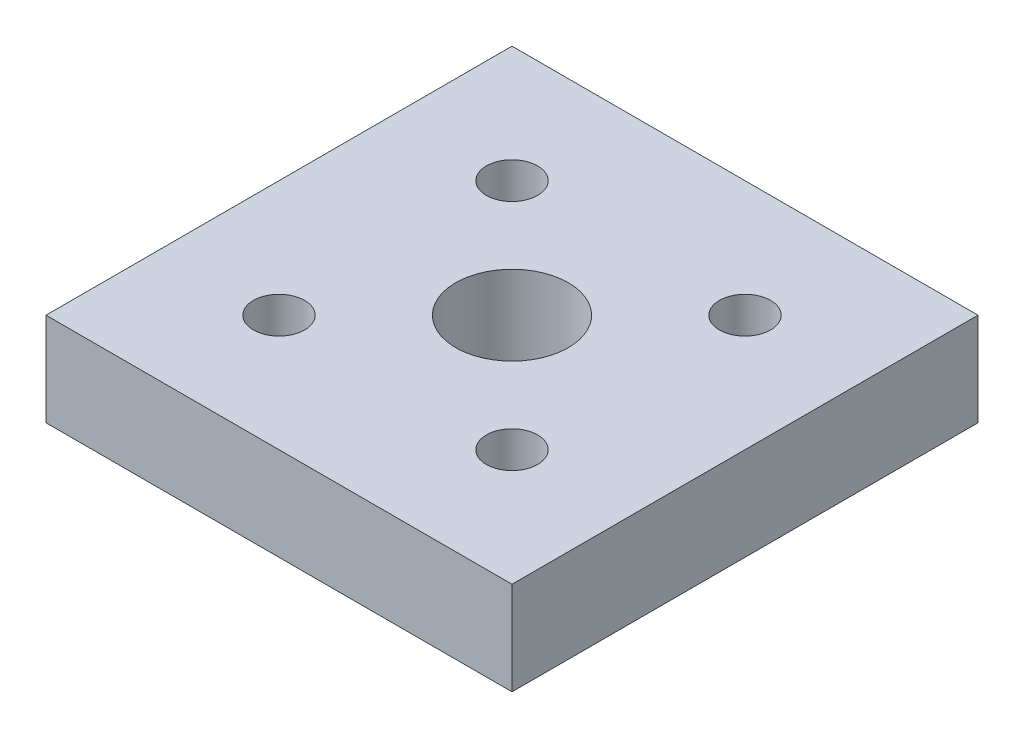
ISO-10303-21;
HEADER;
FILE_DESCRIPTION(('STEP AP214'),'2;1');
FILE_NAME('part.step','',(''),(''),'','','');
FILE_SCHEMA(('AUTOMOTIVE_DESIGN { 1 0 10303 214 1 1 1 1 }'));
ENDSEC;
DATA;
#1=APPLICATION_CONTEXT('core data for automotive mechanical design processes');
#2=APPLICATION_PROTOCOL_DEFINITION('international standard','automotive_design',2000,#1);
#3=PRODUCT_CONTEXT('',#1,'mechanical');
#4=PRODUCT('Part','Part','',(#3));
#5=PRODUCT_RELATED_PRODUCT_CATEGORY('part','',(#4));
#6=PRODUCT_DEFINITION_FORMATION('','',#4);
#7=PRODUCT_DEFINITION_CONTEXT('part definition',#1,'design');
#8=PRODUCT_DEFINITION('design','',#6,#7);
#9=PRODUCT_DEFINITION_SHAPE('','',#8);
#10=(LENGTH_UNIT() NAMED_UNIT(*) SI_UNIT(.MILLI.,.METRE.));
#11=(NAMED_UNIT(*) PLANE_ANGLE_UNIT() SI_UNIT($,.RADIAN.));
#12=(NAMED_UNIT(*) SI_UNIT($,.STERADIAN.) SOLID_ANGLE_UNIT());
#13=UNCERTAINTY_MEASURE_WITH_UNIT(LENGTH_MEASURE(1.E-05),#10,'distance_accuracy_value','');
#14=(GEOMETRIC_REPRESENTATION_CONTEXT(3) GLOBAL_UNCERTAINTY_ASSIGNED_CONTEXT((#13)) GLOBAL_UNIT_ASSIGNED_CONTEXT((#10,
#11,#12)) REPRESENTATION_CONTEXT('',''));
#15=CARTESIAN_POINT('',(0.,0.,0.));
#16=DIRECTION('',(0.,0.,1.));
#17=DIRECTION('',(1.,0.,0.));
#18=AXIS2_PLACEMENT_3D('',#15,#16,#17);
#19=CARTESIAN_POINT('',(0.,12.,0.));
#20=DIRECTION('',(1.,0.,0.));
#21=DIRECTION('',(0.,0.,-1.));
#22=AXIS2_PLACEMENT_3D('',#19,#20,#21);
#23=PLANE('',#22);
#24=DIRECTION('',(0.,0.,1.));
#25=VECTOR('',#24,1.);
#26=CARTESIAN_POINT('',(0.,0.,0.));
#27=LINE('',#26,#25);
#28=CARTESIAN_POINT('',(0.,0.,-60.));
#29=VERTEX_POINT('',#28);
#30=CARTESIAN_POINT('',(0.,0.,0.));
#31=VERTEX_POINT('',#30);
#32=EDGE_CURVE('E102',#29,#31,#27,.T.);
#33=ORIENTED_EDGE('',*,*,#32,.T.);
#34=DIRECTION('',(0.,-1.,0.));
#35=VECTOR('',#34,1.);
#36=CARTESIAN_POINT('',(0.,12.,0.));
#37=LINE('',#36,#35);
#38=CARTESIAN_POINT('',(0.,12.,0.));
#39=VERTEX_POINT('',#38);
#40=EDGE_CURVE('E11',#39,#31,#37,.T.);
#41=ORIENTED_EDGE('',*,*,#40,.F.);
#42=DIRECTION('',(0.,0.,1.));
#43=VECTOR('',#42,1.);
#44=CARTESIAN_POINT('',(0.,12.,0.));
#45=LINE('',#44,#43);
#46=CARTESIAN_POINT('',(0.,12.,-60.));
#47=VERTEX_POINT('',#46);
#48=EDGE_CURVE('E90',#47,#39,#45,.T.);
#49=ORIENTED_EDGE('',*,*,#48,.F.);
#50=DIRECTION('',(0.,-1.,0.));
#51=VECTOR('',#50,1.);
#52=CARTESIAN_POINT('',(0.,12.,-60.));
#53=LINE('',#52,#51);
#54=EDGE_CURVE('E98',#47,#29,#53,.T.);
#55=ORIENTED_EDGE('',*,*,#54,.T.);
#56=EDGE_LOOP('',(#33,#41,#49,#55));
#57=FACE_BOUND('',#56,.T.);
#58=ADVANCED_FACE('F39',(#57),#23,.F.);
#59=CARTESIAN_POINT('',(0.,12.,0.));
#60=DIRECTION('',(0.,0.,-1.));
#61=DIRECTION('',(-1.,0.,0.));
#62=AXIS2_PLACEMENT_3D('',#59,#60,#61);
#63=PLANE('',#62);
#64=DIRECTION('',(1.,0.,0.));
#65=VECTOR('',#64,1.);
#66=CARTESIAN_POINT('',(0.,0.,0.));
#67=LINE('',#66,#65);
#68=CARTESIAN_POINT('',(60.,0.,0.));
#69=VERTEX_POINT('',#68);
#70=EDGE_CURVE('E94',#31,#69,#67,.T.);
#71=ORIENTED_EDGE('',*,*,#70,.T.);
#72=DIRECTION('',(0.,-1.,0.));
#73=VECTOR('',#72,1.);
#74=CARTESIAN_POINT('',(60.,12.,0.));
#75=LINE('',#74,#73);
#76=CARTESIAN_POINT('',(60.,12.,0.));
#77=VERTEX_POINT('',#76);
#78=EDGE_CURVE('E47',#77,#69,#75,.T.);
#79=ORIENTED_EDGE('',*,*,#78,.F.);
#80=DIRECTION('',(1.,0.,0.));
#81=VECTOR('',#80,1.);
#82=CARTESIAN_POINT('',(0.,12.,0.));
#83=LINE('',#82,#81);
#84=EDGE_CURVE('E85',#39,#77,#83,.T.);
#85=ORIENTED_EDGE('',*,*,#84,.F.);
#86=ORIENTED_EDGE('',*,*,#40,.T.);
#87=EDGE_LOOP('',(#71,#79,#85,#86));
#88=FACE_BOUND('',#87,.T.);
#89=ADVANCED_FACE('F93',(#88),#63,.F.);
#90=CARTESIAN_POINT('',(60.,12.,0.));
#91=DIRECTION('',(-1.,0.,0.));
#92=DIRECTION('',(0.,0.,1.));
#93=AXIS2_PLACEMENT_3D('',#90,#91,#92);
#94=PLANE('',#93);
#95=DIRECTION('',(0.,0.,-1.));
#96=VECTOR('',#95,1.);
#97=CARTESIAN_POINT('',(60.,0.,0.));
#98=LINE('',#97,#96);
#99=CARTESIAN_POINT('',(60.,0.,-60.));
#100=VERTEX_POINT('',#99);
#101=EDGE_CURVE('E72',#69,#100,#98,.T.);
#102=ORIENTED_EDGE('',*,*,#101,.T.);
#103=DIRECTION('',(0.,-1.,0.));
#104=VECTOR('',#103,1.);
#105=CARTESIAN_POINT('',(60.,12.,-60.));
#106=LINE('',#105,#104);
#107=CARTESIAN_POINT('',(60.,12.,-60.));
#108=VERTEX_POINT('',#107);
#109=EDGE_CURVE('E95',#108,#100,#106,.T.);
#110=ORIENTED_EDGE('',*,*,#109,.F.);
#111=DIRECTION('',(0.,0.,-1.));
#112=VECTOR('',#111,1.);
#113=CARTESIAN_POINT('',(60.,12.,0.));
#114=LINE('',#113,#112);
#115=EDGE_CURVE('E88',#77,#108,#114,.T.);
#116=ORIENTED_EDGE('',*,*,#115,.F.);
#117=ORIENTED_EDGE('',*,*,#78,.T.);
#118=EDGE_LOOP('',(#102,#110,#116,#117));
#119=FACE_BOUND('',#118,.T.);
#120=ADVANCED_FACE('F96',(#119),#94,.F.);
#121=CARTESIAN_POINT('',(0.,12.,-60.));
#122=DIRECTION('',(0.,0.,1.));
#123=DIRECTION('',(1.,0.,0.));
#124=AXIS2_PLACEMENT_3D('',#121,#122,#123);
#125=PLANE('',#124);
#126=DIRECTION('',(-1.,0.,0.));
#127=VECTOR('',#126,1.);
#128=CARTESIAN_POINT('',(0.,0.,-60.));
#129=LINE('',#128,#127);
#130=EDGE_CURVE('E78',#100,#29,#129,.T.);
#131=ORIENTED_EDGE('',*,*,#130,.T.);
#132=ORIENTED_EDGE('',*,*,#54,.F.);
#133=DIRECTION('',(-1.,0.,0.));
#134=VECTOR('',#133,1.);
#135=CARTESIAN_POINT('',(0.,12.,-60.));
#136=LINE('',#135,#134);
#137=EDGE_CURVE('E55',#108,#47,#136,.T.);
#138=ORIENTED_EDGE('',*,*,#137,.F.);
#139=ORIENTED_EDGE('',*,*,#109,.T.);
#140=EDGE_LOOP('',(#131,#132,#138,#139));
#141=FACE_BOUND('',#140,.T.);
#142=ADVANCED_FACE('F110',(#141),#125,.F.);
#143=CARTESIAN_POINT('',(0.,12.,-60.));
#144=DIRECTION('',(0.,-1.,0.));
#145=DIRECTION('',(0.,0.,-1.));
#146=AXIS2_PLACEMENT_3D('',#143,#144,#145);
#147=PLANE('',#146);
#148=CARTESIAN_POINT('',(15.,12.,-15.));
#149=DIRECTION('',(0.,-1.,0.));
#150=DIRECTION('',(0.,0.,-1.));
#151=AXIS2_PLACEMENT_3D('',#148,#149,#150);
#152=CIRCLE('',#151,3.30000000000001);
#153=CARTESIAN_POINT('',(15.,12.,-18.3));
#154=VERTEX_POINT('',#153);
#155=EDGE_CURVE('E157',#154,#154,#152,.T.);
#156=ORIENTED_EDGE('',*,*,#155,.T.);
#157=EDGE_LOOP('',(#156));
#158=FACE_BOUND('',#157,.T.);
#159=CARTESIAN_POINT('',(45.,12.,-15.));
#160=DIRECTION('',(0.,-1.,0.));
#161=DIRECTION('',(0.,0.,-1.));
#162=AXIS2_PLACEMENT_3D('',#159,#160,#161);
#163=CIRCLE('',#162,3.30000000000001);
#164=CARTESIAN_POINT('',(45.,12.,-18.3));
#165=VERTEX_POINT('',#164);
#166=EDGE_CURVE('E145',#165,#165,#163,.T.);
#167=ORIENTED_EDGE('',*,*,#166,.T.);
#168=EDGE_LOOP('',(#167));
#169=FACE_BOUND('',#168,.T.);
#170=CARTESIAN_POINT('',(45.,12.,-45.));
#171=DIRECTION('',(0.,-1.,0.));
#172=DIRECTION('',(0.,0.,-1.));
#173=AXIS2_PLACEMENT_3D('',#170,#171,#172);
#174=CIRCLE('',#173,3.30000000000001);
#175=CARTESIAN_POINT('',(45.,12.,-48.3));
#176=VERTEX_POINT('',#175);
#177=EDGE_CURVE('E133',#176,#176,#174,.T.);
#178=ORIENTED_EDGE('',*,*,#177,.T.);
#179=EDGE_LOOP('',(#178));
#180=FACE_BOUND('',#179,.T.);
#181=CARTESIAN_POINT('',(15.,12.,-45.));
#182=DIRECTION('',(0.,-1.,0.));
#183=DIRECTION('',(0.,0.,-1.));
#184=AXIS2_PLACEMENT_3D('',#181,#182,#183);
#185=CIRCLE('',#184,3.30000000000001);
#186=CARTESIAN_POINT('',(15.,12.,-48.3));
#187=VERTEX_POINT('',#186);
#188=EDGE_CURVE('E121',#187,#187,#185,.T.);
#189=ORIENTED_EDGE('',*,*,#188,.T.);
#190=EDGE_LOOP('',(#189));
#191=FACE_BOUND('',#190,.T.);
#192=CARTESIAN_POINT('',(30.,12.,-30.));
#193=DIRECTION('',(0.,-1.,0.));
#194=DIRECTION('',(0.,0.,-1.));
#195=AXIS2_PLACEMENT_3D('',#192,#193,#194);
#196=CIRCLE('',#195,7.25);
#197=CARTESIAN_POINT('',(30.,12.,-37.25));
#198=VERTEX_POINT('',#197);
#199=EDGE_CURVE('E105',#198,#198,#196,.T.);
#200=ORIENTED_EDGE('',*,*,#199,.T.);
#201=EDGE_LOOP('',(#200));
#202=FACE_BOUND('',#201,.T.);
#203=ORIENTED_EDGE('',*,*,#48,.T.);
#204=ORIENTED_EDGE('',*,*,#84,.T.);
#205=ORIENTED_EDGE('',*,*,#115,.T.);
#206=ORIENTED_EDGE('',*,*,#137,.T.);
#207=EDGE_LOOP('',(#203,#204,#205,#206));
#208=FACE_BOUND('',#207,.T.);
#209=ADVANCED_FACE('F86',(#158,#169,#180,#191,#202,#208),#147,.F.);
#210=CARTESIAN_POINT('',(0.,0.,-60.));
#211=DIRECTION('',(0.,-1.,0.));
#212=DIRECTION('',(0.,0.,-1.));
#213=AXIS2_PLACEMENT_3D('',#210,#211,#212);
#214=PLANE('',#213);
#215=CARTESIAN_POINT('',(15.,0.,-15.));
#216=DIRECTION('',(0.,-1.,0.));
#217=DIRECTION('',(0.,0.,-1.));
#218=AXIS2_PLACEMENT_3D('',#215,#216,#217);
#219=CIRCLE('',#218,5.50000000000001);
#220=CARTESIAN_POINT('',(15.,0.,-20.5));
#221=VERTEX_POINT('',#220);
#222=EDGE_CURVE('E166',#221,#221,#219,.T.);
#223=ORIENTED_EDGE('',*,*,#222,.F.);
#224=EDGE_LOOP('',(#223));
#225=FACE_BOUND('',#224,.T.);
#226=CARTESIAN_POINT('',(45.,0.,-15.));
#227=DIRECTION('',(0.,-1.,0.));
#228=DIRECTION('',(0.,0.,-1.));
#229=AXIS2_PLACEMENT_3D('',#226,#227,#228);
#230=CIRCLE('',#229,5.50000000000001);
#231=CARTESIAN_POINT('',(45.,0.,-20.5));
#232=VERTEX_POINT('',#231);
#233=EDGE_CURVE('E154',#232,#232,#230,.T.);
#234=ORIENTED_EDGE('',*,*,#233,.F.);
#235=EDGE_LOOP('',(#234));
#236=FACE_BOUND('',#235,.T.);
#237=CARTESIAN_POINT('',(45.,0.,-45.));
#238=DIRECTION('',(0.,-1.,0.));
#239=DIRECTION('',(0.,0.,-1.));
#240=AXIS2_PLACEMENT_3D('',#237,#238,#239);
#241=CIRCLE('',#240,5.50000000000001);
#242=CARTESIAN_POINT('',(45.,0.,-50.5));
#243=VERTEX_POINT('',#242);
#244=EDGE_CURVE('E142',#243,#243,#241,.T.);
#245=ORIENTED_EDGE('',*,*,#244,.F.);
#246=EDGE_LOOP('',(#245));
#247=FACE_BOUND('',#246,.T.);
#248=CARTESIAN_POINT('',(15.,0.,-45.));
#249=DIRECTION('',(0.,-1.,0.));
#250=DIRECTION('',(0.,0.,-1.));
#251=AXIS2_PLACEMENT_3D('',#248,#249,#250);
#252=CIRCLE('',#251,5.50000000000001);
#253=CARTESIAN_POINT('',(15.,0.,-50.5));
#254=VERTEX_POINT('',#253);
#255=EDGE_CURVE('E130',#254,#254,#252,.T.);
#256=ORIENTED_EDGE('',*,*,#255,.F.);
#257=EDGE_LOOP('',(#256));
#258=FACE_BOUND('',#257,.T.);
#259=CARTESIAN_POINT('',(30.,0.,-30.));
#260=DIRECTION('',(0.,-1.,0.));
#261=DIRECTION('',(0.,0.,-1.));
#262=AXIS2_PLACEMENT_3D('',#259,#260,#261);
#263=CIRCLE('',#262,7.25);
#264=CARTESIAN_POINT('',(30.,0.,-37.25));
#265=VERTEX_POINT('',#264);
#266=EDGE_CURVE('E118',#265,#265,#263,.T.);
#267=ORIENTED_EDGE('',*,*,#266,.F.);
#268=EDGE_LOOP('',(#267));
#269=FACE_BOUND('',#268,.T.);
#270=ORIENTED_EDGE('',*,*,#32,.F.);
#271=ORIENTED_EDGE('',*,*,#130,.F.);
#272=ORIENTED_EDGE('',*,*,#101,.F.);
#273=ORIENTED_EDGE('',*,*,#70,.F.);
#274=EDGE_LOOP('',(#270,#271,#272,#273));
#275=FACE_BOUND('',#274,.T.);
#276=ADVANCED_FACE('F113',(#225,#236,#247,#258,#269,#275),#214,.T.);
#277=CARTESIAN_POINT('',(30.,0.,-30.));
#278=DIRECTION('',(0.,-1.,0.));
#279=DIRECTION('',(0.,0.,-1.));
#280=AXIS2_PLACEMENT_3D('',#277,#278,#279);
#281=CYLINDRICAL_SURFACE('',#280,7.25);
#282=ORIENTED_EDGE('',*,*,#199,.F.);
#283=EDGE_LOOP('',(#282));
#284=FACE_BOUND('',#283,.T.);
#285=ORIENTED_EDGE('',*,*,#266,.T.);
#286=EDGE_LOOP('',(#285));
#287=FACE_BOUND('',#286,.T.);
#288=ADVANCED_FACE('F174',(#284,#287),#281,.F.);
#289=CARTESIAN_POINT('',(15.,0.,-45.));
#290=DIRECTION('',(0.,-1.,0.));
#291=DIRECTION('',(0.,0.,-1.));
#292=AXIS2_PLACEMENT_3D('',#289,#290,#291);
#293=CYLINDRICAL_SURFACE('',#292,3.30000000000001);
#294=ORIENTED_EDGE('',*,*,#188,.F.);
#295=EDGE_LOOP('',(#294));
#296=FACE_BOUND('',#295,.T.);
#297=CARTESIAN_POINT('',(15.,6.5,-45.));
#298=DIRECTION('',(0.,-1.,0.));
#299=DIRECTION('',(0.,0.,-1.));
#300=AXIS2_PLACEMENT_3D('',#297,#298,#299);
#301=CIRCLE('',#300,3.30000000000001);
#302=CARTESIAN_POINT('',(15.,6.5,-48.3));
#303=VERTEX_POINT('',#302);
#304=EDGE_CURVE('E124',#303,#303,#301,.T.);
#305=ORIENTED_EDGE('',*,*,#304,.T.);
#306=EDGE_LOOP('',(#305));
#307=FACE_BOUND('',#306,.T.);
#308=ADVANCED_FACE('F185',(#296,#307),#293,.F.);
#309=CARTESIAN_POINT('',(18.3,6.5,-45.));
#310=DIRECTION('',(0.,1.,0.));
#311=DIRECTION('',(0.,0.,1.));
#312=AXIS2_PLACEMENT_3D('',#309,#310,#311);
#313=PLANE('',#312);
#314=ORIENTED_EDGE('',*,*,#304,.F.);
#315=EDGE_LOOP('',(#314));
#316=FACE_BOUND('',#315,.T.);
#317=CARTESIAN_POINT('',(15.,6.5,-45.));
#318=DIRECTION('',(0.,-1.,0.));
#319=DIRECTION('',(0.,0.,-1.));
#320=AXIS2_PLACEMENT_3D('',#317,#318,#319);
#321=CIRCLE('',#320,5.50000000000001);
#322=CARTESIAN_POINT('',(15.,6.5,-50.5));
#323=VERTEX_POINT('',#322);
#324=EDGE_CURVE('E127',#323,#323,#321,.T.);
#325=ORIENTED_EDGE('',*,*,#324,.T.);
#326=EDGE_LOOP('',(#325));
#327=FACE_BOUND('',#326,.T.);
#328=ADVANCED_FACE('F191',(#316,#327),#313,.F.);
#329=CARTESIAN_POINT('',(15.,0.,-45.));
#330=DIRECTION('',(0.,-1.,0.));
#331=DIRECTION('',(0.,0.,-1.));
#332=AXIS2_PLACEMENT_3D('',#329,#330,#331);
#333=CYLINDRICAL_SURFACE('',#332,5.50000000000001);
#334=ORIENTED_EDGE('',*,*,#324,.F.);
#335=EDGE_LOOP('',(#334));
#336=FACE_BOUND('',#335,.T.);
#337=ORIENTED_EDGE('',*,*,#255,.T.);
#338=EDGE_LOOP('',(#337));
#339=FACE_BOUND('',#338,.T.);
#340=ADVANCED_FACE('F223',(#336,#339),#333,.F.);
#341=CARTESIAN_POINT('',(45.,0.,-45.));
#342=DIRECTION('',(0.,-1.,0.));
#343=DIRECTION('',(0.,0.,-1.));
#344=AXIS2_PLACEMENT_3D('',#341,#342,#343);
#345=CYLINDRICAL_SURFACE('',#344,3.30000000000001);
#346=ORIENTED_EDGE('',*,*,#177,.F.);
#347=EDGE_LOOP('',(#346));
#348=FACE_BOUND('',#347,.T.);
#349=CARTESIAN_POINT('',(45.,6.5,-45.));
#350=DIRECTION('',(0.,-1.,0.));
#351=DIRECTION('',(0.,0.,-1.));
#352=AXIS2_PLACEMENT_3D('',#349,#350,#351);
#353=CIRCLE('',#352,3.30000000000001);
#354=CARTESIAN_POINT('',(45.,6.5,-48.3));
#355=VERTEX_POINT('',#354);
#356=EDGE_CURVE('E136',#355,#355,#353,.T.);
#357=ORIENTED_EDGE('',*,*,#356,.T.);
#358=EDGE_LOOP('',(#357));
#359=FACE_BOUND('',#358,.T.);
#360=ADVANCED_FACE('F229',(#348,#359),#345,.F.);
#361=CARTESIAN_POINT('',(48.3,6.5,-45.));
#362=DIRECTION('',(0.,1.,0.));
#363=DIRECTION('',(0.,0.,1.));
#364=AXIS2_PLACEMENT_3D('',#361,#362,#363);
#365=PLANE('',#364);
#366=ORIENTED_EDGE('',*,*,#356,.F.);
#367=EDGE_LOOP('',(#366));
#368=FACE_BOUND('',#367,.T.);
#369=CARTESIAN_POINT('',(45.,6.5,-45.));
#370=DIRECTION('',(0.,-1.,0.));
#371=DIRECTION('',(0.,0.,-1.));
#372=AXIS2_PLACEMENT_3D('',#369,#370,#371);
#373=CIRCLE('',#372,5.50000000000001);
#374=CARTESIAN_POINT('',(45.,6.5,-50.5));
#375=VERTEX_POINT('',#374);
#376=EDGE_CURVE('E139',#375,#375,#373,.T.);
#377=ORIENTED_EDGE('',*,*,#376,.T.);
#378=EDGE_LOOP('',(#377));
#379=FACE_BOUND('',#378,.T.);
#380=ADVANCED_FACE('F234',(#368,#379),#365,.F.);
#381=CARTESIAN_POINT('',(45.,0.,-45.));
#382=DIRECTION('',(0.,-1.,0.));
#383=DIRECTION('',(0.,0.,-1.));
#384=AXIS2_PLACEMENT_3D('',#381,#382,#383);
#385=CYLINDRICAL_SURFACE('',#384,5.50000000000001);
#386=ORIENTED_EDGE('',*,*,#376,.F.);
#387=EDGE_LOOP('',(#386));
#388=FACE_BOUND('',#387,.T.);
#389=ORIENTED_EDGE('',*,*,#244,.T.);
#390=EDGE_LOOP('',(#389));
#391=FACE_BOUND('',#390,.T.);
#392=ADVANCED_FACE('F240',(#388,#391),#385,.F.);
#393=CARTESIAN_POINT('',(45.,0.,-15.));
#394=DIRECTION('',(0.,-1.,0.));
#395=DIRECTION('',(0.,0.,-1.));
#396=AXIS2_PLACEMENT_3D('',#393,#394,#395);
#397=CYLINDRICAL_SURFACE('',#396,3.30000000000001);
#398=ORIENTED_EDGE('',*,*,#166,.F.);
#399=EDGE_LOOP('',(#398));
#400=FACE_BOUND('',#399,.T.);
#401=CARTESIAN_POINT('',(45.,6.5,-15.));
#402=DIRECTION('',(0.,-1.,0.));
#403=DIRECTION('',(0.,0.,-1.));
#404=AXIS2_PLACEMENT_3D('',#401,#402,#403);
#405=CIRCLE('',#404,3.30000000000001);
#406=CARTESIAN_POINT('',(45.,6.5,-18.3));
#407=VERTEX_POINT('',#406);
#408=EDGE_CURVE('E148',#407,#407,#405,.T.);
#409=ORIENTED_EDGE('',*,*,#408,.T.);
#410=EDGE_LOOP('',(#409));
#411=FACE_BOUND('',#410,.T.);
#412=ADVANCED_FACE('F244',(#400,#411),#397,.F.);
#413=CARTESIAN_POINT('',(48.3,6.5,-15.));
#414=DIRECTION('',(0.,1.,0.));
#415=DIRECTION('',(0.,0.,1.));
#416=AXIS2_PLACEMENT_3D('',#413,#414,#415);
#417=PLANE('',#416);
#418=ORIENTED_EDGE('',*,*,#408,.F.);
#419=EDGE_LOOP('',(#418));
#420=FACE_BOUND('',#419,.T.);
#421=CARTESIAN_POINT('',(45.,6.5,-15.));
#422=DIRECTION('',(0.,-1.,0.));
#423=DIRECTION('',(0.,0.,-1.));
#424=AXIS2_PLACEMENT_3D('',#421,#422,#423);
#425=CIRCLE('',#424,5.50000000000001);
#426=CARTESIAN_POINT('',(45.,6.5,-20.5));
#427=VERTEX_POINT('',#426);
#428=EDGE_CURVE('E151',#427,#427,#425,.T.);
#429=ORIENTED_EDGE('',*,*,#428,.T.);
#430=EDGE_LOOP('',(#429));
#431=FACE_BOUND('',#430,.T.);
#432=ADVANCED_FACE('F248',(#420,#431),#417,.F.);
#433=CARTESIAN_POINT('',(45.,0.,-15.));
#434=DIRECTION('',(0.,-1.,0.));
#435=DIRECTION('',(0.,0.,-1.));
#436=AXIS2_PLACEMENT_3D('',#433,#434,#435);
#437=CYLINDRICAL_SURFACE('',#436,5.50000000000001);
#438=ORIENTED_EDGE('',*,*,#428,.F.);
#439=EDGE_LOOP('',(#438));
#440=FACE_BOUND('',#439,.T.);
#441=ORIENTED_EDGE('',*,*,#233,.T.);
#442=EDGE_LOOP('',(#441));
#443=FACE_BOUND('',#442,.T.);
#444=ADVANCED_FACE('F252',(#440,#443),#437,.F.);
#445=CARTESIAN_POINT('',(15.,0.,-15.));
#446=DIRECTION('',(0.,-1.,0.));
#447=DIRECTION('',(0.,0.,-1.));
#448=AXIS2_PLACEMENT_3D('',#445,#446,#447);
#449=CYLINDRICAL_SURFACE('',#448,3.30000000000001);
#450=ORIENTED_EDGE('',*,*,#155,.F.);
#451=EDGE_LOOP('',(#450));
#452=FACE_BOUND('',#451,.T.);
#453=CARTESIAN_POINT('',(15.,6.5,-15.));
#454=DIRECTION('',(0.,-1.,0.));
#455=DIRECTION('',(0.,0.,-1.));
#456=AXIS2_PLACEMENT_3D('',#453,#454,#455);
#457=CIRCLE('',#456,3.30000000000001);
#458=CARTESIAN_POINT('',(15.,6.5,-18.3));
#459=VERTEX_POINT('',#458);
#460=EDGE_CURVE('E160',#459,#459,#457,.T.);
#461=ORIENTED_EDGE('',*,*,#460,.T.);
#462=EDGE_LOOP('',(#461));
#463=FACE_BOUND('',#462,.T.);
#464=ADVANCED_FACE('F256',(#452,#463),#449,.F.);
#465=CARTESIAN_POINT('',(18.3,6.5,-15.));
#466=DIRECTION('',(0.,1.,0.));
#467=DIRECTION('',(0.,0.,1.));
#468=AXIS2_PLACEMENT_3D('',#465,#466,#467);
#469=PLANE('',#468);
#470=ORIENTED_EDGE('',*,*,#460,.F.);
#471=EDGE_LOOP('',(#470));
#472=FACE_BOUND('',#471,.T.);
#473=CARTESIAN_POINT('',(15.,6.5,-15.));
#474=DIRECTION('',(0.,-1.,0.));
#475=DIRECTION('',(0.,0.,-1.));
#476=AXIS2_PLACEMENT_3D('',#473,#474,#475);
#477=CIRCLE('',#476,5.50000000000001);
#478=CARTESIAN_POINT('',(15.,6.5,-20.5));
#479=VERTEX_POINT('',#478);
#480=EDGE_CURVE('E163',#479,#479,#477,.T.);
#481=ORIENTED_EDGE('',*,*,#480,.T.);
#482=EDGE_LOOP('',(#481));
#483=FACE_BOUND('',#482,.T.);
#484=ADVANCED_FACE('F260',(#472,#483),#469,.F.);
#485=CARTESIAN_POINT('',(15.,0.,-15.));
#486=DIRECTION('',(0.,-1.,0.));
#487=DIRECTION('',(0.,0.,-1.));
#488=AXIS2_PLACEMENT_3D('',#485,#486,#487);
#489=CYLINDRICAL_SURFACE('',#488,5.50000000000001);
#490=ORIENTED_EDGE('',*,*,#480,.F.);
#491=EDGE_LOOP('',(#490));
#492=FACE_BOUND('',#491,.T.);
#493=ORIENTED_EDGE('',*,*,#222,.T.);
#494=EDGE_LOOP('',(#493));
#495=FACE_BOUND('',#494,.T.);
#496=ADVANCED_FACE('F170',(#492,#495),#489,.F.);
#497=CLOSED_SHELL('',(#58,#89,#120,#142,#209,#276,#288,#308,#328,#340,#360,#380,#392,#412,#432,
#444,#464,#484,#496));
#498=MANIFOLD_SOLID_BREP('B2',#497);
#499=ADVANCED_BREP_SHAPE_REPRESENTATION('',(#18,#498),#14);
#500=SHAPE_DEFINITION_REPRESENTATION(#9,#499);
ENDSEC;
END-ISO-10303-21;
